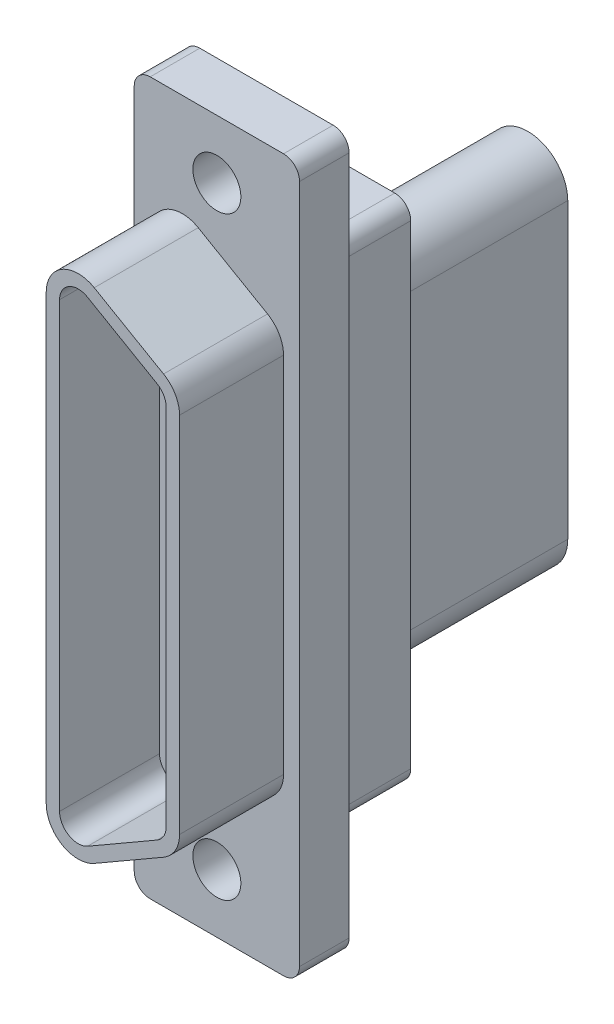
ISO-10303-21;
HEADER;
FILE_DESCRIPTION(('STEP AP214'),'2;1');
FILE_NAME('part.step','',(''),(''),'','','');
FILE_SCHEMA(('AUTOMOTIVE_DESIGN { 1 0 10303 214 1 1 1 1 }'));
ENDSEC;
DATA;
#1=APPLICATION_CONTEXT('core data for automotive mechanical design processes');
#2=APPLICATION_PROTOCOL_DEFINITION('international standard','automotive_design',2000,#1);
#3=PRODUCT_CONTEXT('',#1,'mechanical');
#4=PRODUCT('Part','Part','',(#3));
#5=PRODUCT_RELATED_PRODUCT_CATEGORY('part','',(#4));
#6=PRODUCT_DEFINITION_FORMATION('','',#4);
#7=PRODUCT_DEFINITION_CONTEXT('part definition',#1,'design');
#8=PRODUCT_DEFINITION('design','',#6,#7);
#9=PRODUCT_DEFINITION_SHAPE('','',#8);
#10=(LENGTH_UNIT() NAMED_UNIT(*) SI_UNIT(.MILLI.,.METRE.));
#11=(NAMED_UNIT(*) PLANE_ANGLE_UNIT() SI_UNIT($,.RADIAN.));
#12=(NAMED_UNIT(*) SI_UNIT($,.STERADIAN.) SOLID_ANGLE_UNIT());
#13=UNCERTAINTY_MEASURE_WITH_UNIT(LENGTH_MEASURE(1.E-05),#10,'distance_accuracy_value','');
#14=(GEOMETRIC_REPRESENTATION_CONTEXT(3) GLOBAL_UNCERTAINTY_ASSIGNED_CONTEXT((#13)) GLOBAL_UNIT_ASSIGNED_CONTEXT((#10,
#11,#12)) REPRESENTATION_CONTEXT('',''));
#15=CARTESIAN_POINT('',(0.,0.,0.));
#16=DIRECTION('',(0.,0.,1.));
#17=DIRECTION('',(1.,0.,0.));
#18=AXIS2_PLACEMENT_3D('',#15,#16,#17);
#19=CARTESIAN_POINT('',(1.651,8.64728941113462,7.3152));
#20=DIRECTION('',(0.,0.,1.));
#21=DIRECTION('',(1.,0.,0.));
#22=AXIS2_PLACEMENT_3D('',#19,#20,#21);
#23=CYLINDRICAL_SURFACE('',#22,0.889);
#24=CARTESIAN_POINT('',(1.651,8.64728941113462,2.5527));
#25=DIRECTION('',(0.,0.,1.));
#26=DIRECTION('',(1.,0.,0.));
#27=AXIS2_PLACEMENT_3D('',#24,#25,#26);
#28=CIRCLE('',#27,0.889);
#29=CARTESIAN_POINT('',(2.54,8.64728941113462,2.5527));
#30=VERTEX_POINT('',#29);
#31=CARTESIAN_POINT('',(2.09550000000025,9.41718599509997,2.5527));
#32=VERTEX_POINT('',#31);
#33=EDGE_CURVE('E263',#30,#32,#28,.T.);
#34=ORIENTED_EDGE('',*,*,#33,.F.);
#35=DIRECTION('',(0.,0.,-1.));
#36=VECTOR('',#35,1.);
#37=CARTESIAN_POINT('',(2.54,8.64728941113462,7.3152));
#38=LINE('',#37,#36);
#39=CARTESIAN_POINT('',(2.54,8.64728941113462,7.3152));
#40=VERTEX_POINT('',#39);
#41=EDGE_CURVE('E261',#30,#40,#38,.F.);
#42=ORIENTED_EDGE('',*,*,#41,.T.);
#43=CARTESIAN_POINT('',(1.651,8.64728941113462,7.3152));
#44=DIRECTION('',(0.,0.,1.));
#45=DIRECTION('',(1.,0.,0.));
#46=AXIS2_PLACEMENT_3D('',#43,#44,#45);
#47=CIRCLE('',#46,0.889);
#48=CARTESIAN_POINT('',(2.09550000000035,9.41718599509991,7.3152));
#49=VERTEX_POINT('',#48);
#50=EDGE_CURVE('E19',#49,#40,#47,.F.);
#51=ORIENTED_EDGE('',*,*,#50,.F.);
#52=DIRECTION('',(0.,0.,1.));
#53=VECTOR('',#52,1.);
#54=CARTESIAN_POINT('',(2.0955,9.41718599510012,7.3152));
#55=LINE('',#54,#53);
#56=EDGE_CURVE('E313',#49,#32,#55,.F.);
#57=ORIENTED_EDGE('',*,*,#56,.T.);
#58=EDGE_LOOP('',(#34,#42,#51,#57));
#59=FACE_BOUND('',#58,.T.);
#60=ADVANCED_FACE('F16',(#59),#23,.F.);
#61=CARTESIAN_POINT('',(1.651,-8.64728941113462,7.3152));
#62=DIRECTION('',(0.,0.,1.));
#63=DIRECTION('',(1.,0.,0.));
#64=AXIS2_PLACEMENT_3D('',#61,#62,#63);
#65=CYLINDRICAL_SURFACE('',#64,0.889);
#66=CARTESIAN_POINT('',(1.651,-8.64728941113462,2.5527));
#67=DIRECTION('',(0.,0.,1.));
#68=DIRECTION('',(1.,0.,0.));
#69=AXIS2_PLACEMENT_3D('',#66,#67,#68);
#70=CIRCLE('',#69,0.889);
#71=CARTESIAN_POINT('',(2.09550000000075,-9.41718599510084,2.5527));
#72=VERTEX_POINT('',#71);
#73=CARTESIAN_POINT('',(2.54,-8.64728941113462,2.5527));
#74=VERTEX_POINT('',#73);
#75=EDGE_CURVE('E412',#72,#74,#70,.T.);
#76=ORIENTED_EDGE('',*,*,#75,.F.);
#77=DIRECTION('',(0.,0.,1.));
#78=VECTOR('',#77,1.);
#79=CARTESIAN_POINT('',(2.0955000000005,-9.41718599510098,7.3152));
#80=LINE('',#79,#78);
#81=CARTESIAN_POINT('',(2.0955000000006,-9.41718599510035,7.3152));
#82=VERTEX_POINT('',#81);
#83=EDGE_CURVE('E306',#72,#82,#80,.T.);
#84=ORIENTED_EDGE('',*,*,#83,.T.);
#85=CARTESIAN_POINT('',(1.651,-8.64728941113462,7.3152));
#86=DIRECTION('',(0.,0.,1.));
#87=DIRECTION('',(1.,0.,0.));
#88=AXIS2_PLACEMENT_3D('',#85,#86,#87);
#89=CIRCLE('',#88,0.889);
#90=CARTESIAN_POINT('',(2.54,-8.64728941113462,7.3152));
#91=VERTEX_POINT('',#90);
#92=EDGE_CURVE('E259',#91,#82,#89,.F.);
#93=ORIENTED_EDGE('',*,*,#92,.F.);
#94=DIRECTION('',(0.,0.,-1.));
#95=VECTOR('',#94,1.);
#96=CARTESIAN_POINT('',(2.54,-8.64728941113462,7.3152));
#97=LINE('',#96,#95);
#98=EDGE_CURVE('E272',#91,#74,#97,.T.);
#99=ORIENTED_EDGE('',*,*,#98,.T.);
#100=EDGE_LOOP('',(#76,#84,#93,#99));
#101=FACE_BOUND('',#100,.T.);
#102=ADVANCED_FACE('F417',(#101),#65,.F.);
#103=CARTESIAN_POINT('',(0.,0.,2.5527));
#104=DIRECTION('',(0.,0.,1.));
#105=DIRECTION('',(1.,0.,0.));
#106=AXIS2_PLACEMENT_3D('',#103,#104,#105);
#107=PLANE('',#106);
#108=CARTESIAN_POINT('',(-1.651,10.5537,2.5527));
#109=DIRECTION('',(0.,0.,1.));
#110=DIRECTION('',(1.,0.,0.));
#111=AXIS2_PLACEMENT_3D('',#108,#109,#110);
#112=CIRCLE('',#111,0.889);
#113=CARTESIAN_POINT('',(-1.20650000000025,11.3235965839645,2.5527));
#114=VERTEX_POINT('',#113);
#115=CARTESIAN_POINT('',(-2.54,10.5537,2.5527));
#116=VERTEX_POINT('',#115);
#117=EDGE_CURVE('E315',#114,#116,#112,.T.);
#118=ORIENTED_EDGE('',*,*,#117,.T.);
#119=DIRECTION('',(0.,1.,0.));
#120=VECTOR('',#119,1.);
#121=CARTESIAN_POINT('',(-2.54,10.5537,2.5527));
#122=LINE('',#121,#120);
#123=CARTESIAN_POINT('',(-2.54,-10.5537,2.5527));
#124=VERTEX_POINT('',#123);
#125=EDGE_CURVE('E299',#116,#124,#122,.F.);
#126=ORIENTED_EDGE('',*,*,#125,.T.);
#127=CARTESIAN_POINT('',(-1.651,-10.5537,2.5527));
#128=DIRECTION('',(0.,0.,1.));
#129=DIRECTION('',(1.,0.,0.));
#130=AXIS2_PLACEMENT_3D('',#127,#128,#129);
#131=CIRCLE('',#130,0.889);
#132=CARTESIAN_POINT('',(-1.20649999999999,-11.3235965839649,2.5527));
#133=VERTEX_POINT('',#132);
#134=EDGE_CURVE('E305',#124,#133,#131,.T.);
#135=ORIENTED_EDGE('',*,*,#134,.T.);
#136=DIRECTION('',(0.866025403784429,0.500000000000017,0.));
#137=VECTOR('',#136,1.);
#138=CARTESIAN_POINT('',(-1.2065,-11.3235965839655,2.5527));
#139=LINE('',#138,#137);
#140=EDGE_CURVE('E267',#133,#72,#139,.T.);
#141=ORIENTED_EDGE('',*,*,#140,.T.);
#142=ORIENTED_EDGE('',*,*,#75,.T.);
#143=DIRECTION('',(0.,1.,0.));
#144=VECTOR('',#143,1.);
#145=CARTESIAN_POINT('',(2.54,-8.64728941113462,2.5527));
#146=LINE('',#145,#144);
#147=EDGE_CURVE('E268',#74,#30,#146,.T.);
#148=ORIENTED_EDGE('',*,*,#147,.T.);
#149=ORIENTED_EDGE('',*,*,#33,.T.);
#150=DIRECTION('',(-0.866025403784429,0.500000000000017,0.));
#151=VECTOR('',#150,1.);
#152=CARTESIAN_POINT('',(2.0955,9.41718599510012,2.5527));
#153=LINE('',#152,#151);
#154=EDGE_CURVE('E312',#32,#114,#153,.T.);
#155=ORIENTED_EDGE('',*,*,#154,.T.);
#156=EDGE_LOOP('',(#118,#126,#135,#141,#142,#148,#149,#155));
#157=FACE_BOUND('',#156,.T.);
#158=ADVANCED_FACE('F725',(#157),#107,.T.);
#159=CARTESIAN_POINT('',(-1.651,10.5537,7.3152));
#160=DIRECTION('',(0.,0.,1.));
#161=DIRECTION('',(1.,0.,0.));
#162=AXIS2_PLACEMENT_3D('',#159,#160,#161);
#163=CYLINDRICAL_SURFACE('',#162,0.889);
#164=ORIENTED_EDGE('',*,*,#117,.F.);
#165=DIRECTION('',(0.,0.,1.));
#166=VECTOR('',#165,1.);
#167=CARTESIAN_POINT('',(-1.2065000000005,11.3235965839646,7.3152));
#168=LINE('',#167,#166);
#169=CARTESIAN_POINT('',(-1.2064999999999,11.3235965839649,7.3152));
#170=VERTEX_POINT('',#169);
#171=EDGE_CURVE('E310',#114,#170,#168,.T.);
#172=ORIENTED_EDGE('',*,*,#171,.T.);
#173=CARTESIAN_POINT('',(-1.651,10.5537,7.3152));
#174=DIRECTION('',(0.,0.,1.));
#175=DIRECTION('',(1.,0.,0.));
#176=AXIS2_PLACEMENT_3D('',#173,#174,#175);
#177=CIRCLE('',#176,0.889);
#178=CARTESIAN_POINT('',(-2.54,10.5537,7.3152));
#179=VERTEX_POINT('',#178);
#180=EDGE_CURVE('E278',#179,#170,#177,.F.);
#181=ORIENTED_EDGE('',*,*,#180,.F.);
#182=DIRECTION('',(0.,0.,1.));
#183=VECTOR('',#182,1.);
#184=CARTESIAN_POINT('',(-2.54,10.5537,7.3152));
#185=LINE('',#184,#183);
#186=EDGE_CURVE('E300',#179,#116,#185,.F.);
#187=ORIENTED_EDGE('',*,*,#186,.T.);
#188=EDGE_LOOP('',(#164,#172,#181,#187));
#189=FACE_BOUND('',#188,.T.);
#190=ADVANCED_FACE('F721',(#189),#163,.F.);
#191=CARTESIAN_POINT('',(2.0955,9.41718599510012,7.3152));
#192=DIRECTION('',(0.500000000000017,0.866025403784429,0.));
#193=DIRECTION('',(-0.866025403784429,0.500000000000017,0.));
#194=AXIS2_PLACEMENT_3D('',#191,#192,#193);
#195=PLANE('',#194);
#196=ORIENTED_EDGE('',*,*,#154,.F.);
#197=ORIENTED_EDGE('',*,*,#56,.F.);
#198=DIRECTION('',(0.866025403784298,-0.500000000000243,0.));
#199=VECTOR('',#198,1.);
#200=CARTESIAN_POINT('',(-1.2065,11.3235965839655,7.3152));
#201=LINE('',#200,#199);
#202=EDGE_CURVE('E258',#170,#49,#201,.T.);
#203=ORIENTED_EDGE('',*,*,#202,.F.);
#204=ORIENTED_EDGE('',*,*,#171,.F.);
#205=EDGE_LOOP('',(#196,#197,#203,#204));
#206=FACE_BOUND('',#205,.T.);
#207=ADVANCED_FACE('F718',(#206),#195,.F.);
#208=CARTESIAN_POINT('',(2.54,-8.64728941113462,7.3152));
#209=DIRECTION('',(1.,0.,0.));
#210=DIRECTION('',(0.,0.,-1.));
#211=AXIS2_PLACEMENT_3D('',#208,#209,#210);
#212=PLANE('',#211);
#213=ORIENTED_EDGE('',*,*,#147,.F.);
#214=ORIENTED_EDGE('',*,*,#98,.F.);
#215=DIRECTION('',(0.,1.,0.));
#216=VECTOR('',#215,1.);
#217=CARTESIAN_POINT('',(2.54,0.,7.3152));
#218=LINE('',#217,#216);
#219=EDGE_CURVE('E255',#40,#91,#218,.F.);
#220=ORIENTED_EDGE('',*,*,#219,.F.);
#221=ORIENTED_EDGE('',*,*,#41,.F.);
#222=EDGE_LOOP('',(#213,#214,#220,#221));
#223=FACE_BOUND('',#222,.T.);
#224=ADVANCED_FACE('F271',(#223),#212,.F.);
#225=CARTESIAN_POINT('',(-1.2065,-11.3235965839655,7.3152));
#226=DIRECTION('',(0.500000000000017,-0.866025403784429,0.));
#227=DIRECTION('',(0.866025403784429,0.500000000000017,0.));
#228=AXIS2_PLACEMENT_3D('',#225,#226,#227);
#229=PLANE('',#228);
#230=ORIENTED_EDGE('',*,*,#140,.F.);
#231=DIRECTION('',(0.,0.,1.));
#232=VECTOR('',#231,1.);
#233=CARTESIAN_POINT('',(-1.20650000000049,-11.3235965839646,7.3152));
#234=LINE('',#233,#232);
#235=CARTESIAN_POINT('',(-1.20649999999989,-11.3235965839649,7.3152));
#236=VERTEX_POINT('',#235);
#237=EDGE_CURVE('E303',#133,#236,#234,.T.);
#238=ORIENTED_EDGE('',*,*,#237,.T.);
#239=DIRECTION('',(-0.866025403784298,-0.500000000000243,0.));
#240=VECTOR('',#239,1.);
#241=CARTESIAN_POINT('',(2.0955,-9.41718599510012,7.3152));
#242=LINE('',#241,#240);
#243=EDGE_CURVE('E273',#82,#236,#242,.T.);
#244=ORIENTED_EDGE('',*,*,#243,.F.);
#245=ORIENTED_EDGE('',*,*,#83,.F.);
#246=EDGE_LOOP('',(#230,#238,#244,#245));
#247=FACE_BOUND('',#246,.T.);
#248=ADVANCED_FACE('F420',(#247),#229,.F.);
#249=CARTESIAN_POINT('',(-1.651,-10.5537,7.3152));
#250=DIRECTION('',(0.,0.,1.));
#251=DIRECTION('',(1.,0.,0.));
#252=AXIS2_PLACEMENT_3D('',#249,#250,#251);
#253=CYLINDRICAL_SURFACE('',#252,0.889);
#254=ORIENTED_EDGE('',*,*,#134,.F.);
#255=DIRECTION('',(0.,0.,1.));
#256=VECTOR('',#255,1.);
#257=CARTESIAN_POINT('',(-2.54,-10.5537,7.3152));
#258=LINE('',#257,#256);
#259=CARTESIAN_POINT('',(-2.54,-10.5537,7.3152));
#260=VERTEX_POINT('',#259);
#261=EDGE_CURVE('E296',#124,#260,#258,.T.);
#262=ORIENTED_EDGE('',*,*,#261,.T.);
#263=CARTESIAN_POINT('',(-1.651,-10.5537,7.3152));
#264=DIRECTION('',(0.,0.,1.));
#265=DIRECTION('',(1.,0.,0.));
#266=AXIS2_PLACEMENT_3D('',#263,#264,#265);
#267=CIRCLE('',#266,0.889);
#268=EDGE_CURVE('E276',#236,#260,#267,.F.);
#269=ORIENTED_EDGE('',*,*,#268,.F.);
#270=ORIENTED_EDGE('',*,*,#237,.F.);
#271=EDGE_LOOP('',(#254,#262,#269,#270));
#272=FACE_BOUND('',#271,.T.);
#273=ADVANCED_FACE('F425',(#272),#253,.F.);
#274=CARTESIAN_POINT('',(-2.54,10.5537,7.3152));
#275=DIRECTION('',(-1.,0.,0.));
#276=DIRECTION('',(0.,0.,1.));
#277=AXIS2_PLACEMENT_3D('',#274,#275,#276);
#278=PLANE('',#277);
#279=ORIENTED_EDGE('',*,*,#125,.F.);
#280=ORIENTED_EDGE('',*,*,#186,.F.);
#281=DIRECTION('',(0.,1.,0.));
#282=VECTOR('',#281,1.);
#283=CARTESIAN_POINT('',(-2.54,0.,7.3152));
#284=LINE('',#283,#282);
#285=EDGE_CURVE('E399',#260,#179,#284,.T.);
#286=ORIENTED_EDGE('',*,*,#285,.F.);
#287=ORIENTED_EDGE('',*,*,#261,.F.);
#288=EDGE_LOOP('',(#279,#280,#286,#287));
#289=FACE_BOUND('',#288,.T.);
#290=ADVANCED_FACE('F708',(#289),#278,.F.);
#291=CARTESIAN_POINT('',(1.651,8.64728941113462,2.3622));
#292=DIRECTION('',(0.,0.,1.));
#293=DIRECTION('',(1.,0.,0.));
#294=AXIS2_PLACEMENT_3D('',#291,#292,#293);
#295=CYLINDRICAL_SURFACE('',#294,1.524);
#296=DIRECTION('',(0.,0.,-1.));
#297=VECTOR('',#296,1.);
#298=CARTESIAN_POINT('',(3.175,8.64728941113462,2.3622));
#299=LINE('',#298,#297);
#300=CARTESIAN_POINT('',(3.175,8.64728941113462,2.3622));
#301=VERTEX_POINT('',#300);
#302=CARTESIAN_POINT('',(3.175,8.64728941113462,7.3152));
#303=VERTEX_POINT('',#302);
#304=EDGE_CURVE('E290',#301,#303,#299,.F.);
#305=ORIENTED_EDGE('',*,*,#304,.F.);
#306=CARTESIAN_POINT('',(1.651,8.64728941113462,2.3622));
#307=DIRECTION('',(0.,0.,1.));
#308=DIRECTION('',(1.,0.,0.));
#309=AXIS2_PLACEMENT_3D('',#306,#307,#308);
#310=CIRCLE('',#309,1.524);
#311=CARTESIAN_POINT('',(2.41300000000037,9.96711212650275,2.3622));
#312=VERTEX_POINT('',#311);
#313=EDGE_CURVE('E298',#301,#312,#310,.T.);
#314=ORIENTED_EDGE('',*,*,#313,.T.);
#315=DIRECTION('',(0.,0.,1.));
#316=VECTOR('',#315,1.);
#317=CARTESIAN_POINT('',(2.413,9.96711212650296,2.3622));
#318=LINE('',#317,#316);
#319=CARTESIAN_POINT('',(2.4130000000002,9.96711212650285,7.3152));
#320=VERTEX_POINT('',#319);
#321=EDGE_CURVE('E294',#320,#312,#318,.F.);
#322=ORIENTED_EDGE('',*,*,#321,.F.);
#323=CARTESIAN_POINT('',(1.651,8.64728941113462,7.3152));
#324=DIRECTION('',(0.,0.,1.));
#325=DIRECTION('',(1.,0.,0.));
#326=AXIS2_PLACEMENT_3D('',#323,#324,#325);
#327=CIRCLE('',#326,1.524);
#328=EDGE_CURVE('E402',#303,#320,#327,.T.);
#329=ORIENTED_EDGE('',*,*,#328,.F.);
#330=EDGE_LOOP('',(#305,#314,#322,#329));
#331=FACE_BOUND('',#330,.T.);
#332=ADVANCED_FACE('F704',(#331),#295,.T.);
#333=CARTESIAN_POINT('',(1.651,-8.64728941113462,2.3622));
#334=DIRECTION('',(0.,0.,1.));
#335=DIRECTION('',(1.,0.,0.));
#336=AXIS2_PLACEMENT_3D('',#333,#334,#335);
#337=CYLINDRICAL_SURFACE('',#336,1.524);
#338=DIRECTION('',(0.,0.,1.));
#339=VECTOR('',#338,1.);
#340=CARTESIAN_POINT('',(2.4130000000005,-9.96711212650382,2.3622));
#341=LINE('',#340,#339);
#342=CARTESIAN_POINT('',(2.41300000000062,-9.96711212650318,2.3622));
#343=VERTEX_POINT('',#342);
#344=CARTESIAN_POINT('',(2.4130000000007,-9.96711212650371,7.3152));
#345=VERTEX_POINT('',#344);
#346=EDGE_CURVE('E285',#343,#345,#341,.T.);
#347=ORIENTED_EDGE('',*,*,#346,.F.);
#348=CARTESIAN_POINT('',(1.651,-8.64728941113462,2.3622));
#349=DIRECTION('',(0.,0.,1.));
#350=DIRECTION('',(1.,0.,0.));
#351=AXIS2_PLACEMENT_3D('',#348,#349,#350);
#352=CIRCLE('',#351,1.524);
#353=CARTESIAN_POINT('',(3.175,-8.64728941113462,2.3622));
#354=VERTEX_POINT('',#353);
#355=EDGE_CURVE('E406',#343,#354,#352,.T.);
#356=ORIENTED_EDGE('',*,*,#355,.T.);
#357=DIRECTION('',(0.,0.,-1.));
#358=VECTOR('',#357,1.);
#359=CARTESIAN_POINT('',(3.175,-8.64728941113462,2.3622));
#360=LINE('',#359,#358);
#361=CARTESIAN_POINT('',(3.175,-8.64728941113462,7.3152));
#362=VERTEX_POINT('',#361);
#363=EDGE_CURVE('E289',#362,#354,#360,.T.);
#364=ORIENTED_EDGE('',*,*,#363,.F.);
#365=CARTESIAN_POINT('',(1.651,-8.64728941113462,7.3152));
#366=DIRECTION('',(0.,0.,1.));
#367=DIRECTION('',(1.,0.,0.));
#368=AXIS2_PLACEMENT_3D('',#365,#366,#367);
#369=CIRCLE('',#368,1.524);
#370=EDGE_CURVE('E404',#345,#362,#369,.T.);
#371=ORIENTED_EDGE('',*,*,#370,.F.);
#372=EDGE_LOOP('',(#347,#356,#364,#371));
#373=FACE_BOUND('',#372,.T.);
#374=ADVANCED_FACE('F701',(#373),#337,.T.);
#375=CARTESIAN_POINT('',(0.,0.,7.3152));
#376=DIRECTION('',(0.,0.,1.));
#377=DIRECTION('',(1.,0.,0.));
#378=AXIS2_PLACEMENT_3D('',#375,#376,#377);
#379=PLANE('',#378);
#380=ORIENTED_EDGE('',*,*,#268,.T.);
#381=ORIENTED_EDGE('',*,*,#285,.T.);
#382=ORIENTED_EDGE('',*,*,#180,.T.);
#383=ORIENTED_EDGE('',*,*,#202,.T.);
#384=ORIENTED_EDGE('',*,*,#50,.T.);
#385=ORIENTED_EDGE('',*,*,#219,.T.);
#386=ORIENTED_EDGE('',*,*,#92,.T.);
#387=ORIENTED_EDGE('',*,*,#243,.T.);
#388=EDGE_LOOP('',(#380,#381,#382,#383,#384,#385,#386,#387));
#389=FACE_BOUND('',#388,.T.);
#390=CARTESIAN_POINT('',(-1.651,10.5537,7.3152));
#391=DIRECTION('',(0.,0.,1.));
#392=DIRECTION('',(1.,0.,0.));
#393=AXIS2_PLACEMENT_3D('',#390,#391,#392);
#394=CIRCLE('',#393,1.524);
#395=CARTESIAN_POINT('',(-3.175,10.5537,7.3152));
#396=VERTEX_POINT('',#395);
#397=CARTESIAN_POINT('',(-0.889000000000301,11.8735227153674,7.3152));
#398=VERTEX_POINT('',#397);
#399=EDGE_CURVE('E397',#396,#398,#394,.F.);
#400=ORIENTED_EDGE('',*,*,#399,.F.);
#401=DIRECTION('',(0.,1.,0.));
#402=VECTOR('',#401,1.);
#403=CARTESIAN_POINT('',(-3.175,10.5537,7.3152));
#404=LINE('',#403,#402);
#405=CARTESIAN_POINT('',(-3.175,-10.5537,7.3152));
#406=VERTEX_POINT('',#405);
#407=EDGE_CURVE('E432',#406,#396,#404,.T.);
#408=ORIENTED_EDGE('',*,*,#407,.F.);
#409=CARTESIAN_POINT('',(-1.651,-10.5537,7.3152));
#410=DIRECTION('',(0.,0.,1.));
#411=DIRECTION('',(1.,0.,0.));
#412=AXIS2_PLACEMENT_3D('',#409,#410,#411);
#413=CIRCLE('',#412,1.524);
#414=CARTESIAN_POINT('',(-0.888999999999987,-11.8735227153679,7.3152));
#415=VERTEX_POINT('',#414);
#416=EDGE_CURVE('E394',#415,#406,#413,.F.);
#417=ORIENTED_EDGE('',*,*,#416,.F.);
#418=DIRECTION('',(0.866025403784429,0.500000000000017,0.));
#419=VECTOR('',#418,1.);
#420=CARTESIAN_POINT('',(-0.889,-11.8735227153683,7.3152));
#421=LINE('',#420,#419);
#422=EDGE_CURVE('E282',#345,#415,#421,.F.);
#423=ORIENTED_EDGE('',*,*,#422,.F.);
#424=ORIENTED_EDGE('',*,*,#370,.T.);
#425=DIRECTION('',(0.,1.,0.));
#426=VECTOR('',#425,1.);
#427=CARTESIAN_POINT('',(3.175,-8.64728941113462,7.3152));
#428=LINE('',#427,#426);
#429=EDGE_CURVE('E286',#303,#362,#428,.F.);
#430=ORIENTED_EDGE('',*,*,#429,.F.);
#431=ORIENTED_EDGE('',*,*,#328,.T.);
#432=DIRECTION('',(-0.866025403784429,0.500000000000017,0.));
#433=VECTOR('',#432,1.);
#434=CARTESIAN_POINT('',(2.413,9.96711212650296,7.3152));
#435=LINE('',#434,#433);
#436=EDGE_CURVE('E291',#398,#320,#435,.F.);
#437=ORIENTED_EDGE('',*,*,#436,.F.);
#438=EDGE_LOOP('',(#400,#408,#417,#423,#424,#430,#431,#437));
#439=FACE_BOUND('',#438,.T.);
#440=ADVANCED_FACE('F252',(#389,#439),#379,.T.);
#441=CARTESIAN_POINT('',(-1.651,10.5537,2.3622));
#442=DIRECTION('',(0.,0.,1.));
#443=DIRECTION('',(1.,0.,0.));
#444=AXIS2_PLACEMENT_3D('',#441,#442,#443);
#445=CYLINDRICAL_SURFACE('',#444,1.524);
#446=DIRECTION('',(0.,0.,1.));
#447=VECTOR('',#446,1.);
#448=CARTESIAN_POINT('',(-0.889000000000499,11.8735227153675,2.3622));
#449=LINE('',#448,#447);
#450=CARTESIAN_POINT('',(-0.888999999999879,11.8735227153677,2.3622));
#451=VERTEX_POINT('',#450);
#452=EDGE_CURVE('E295',#451,#398,#449,.T.);
#453=ORIENTED_EDGE('',*,*,#452,.F.);
#454=CARTESIAN_POINT('',(-1.651,10.5537,2.3622));
#455=DIRECTION('',(0.,0.,1.));
#456=DIRECTION('',(1.,0.,0.));
#457=AXIS2_PLACEMENT_3D('',#454,#455,#456);
#458=CIRCLE('',#457,1.524);
#459=CARTESIAN_POINT('',(-3.175,10.5537,2.3622));
#460=VERTEX_POINT('',#459);
#461=EDGE_CURVE('E373',#460,#451,#458,.F.);
#462=ORIENTED_EDGE('',*,*,#461,.F.);
#463=DIRECTION('',(0.,0.,1.));
#464=VECTOR('',#463,1.);
#465=CARTESIAN_POINT('',(-3.175,10.5537,2.3622));
#466=LINE('',#465,#464);
#467=EDGE_CURVE('E393',#396,#460,#466,.F.);
#468=ORIENTED_EDGE('',*,*,#467,.F.);
#469=ORIENTED_EDGE('',*,*,#399,.T.);
#470=EDGE_LOOP('',(#453,#462,#468,#469));
#471=FACE_BOUND('',#470,.T.);
#472=ADVANCED_FACE('F694',(#471),#445,.T.);
#473=CARTESIAN_POINT('',(2.413,9.96711212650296,2.3622));
#474=DIRECTION('',(0.500000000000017,0.866025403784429,0.));
#475=DIRECTION('',(-0.866025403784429,0.500000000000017,0.));
#476=AXIS2_PLACEMENT_3D('',#473,#474,#475);
#477=PLANE('',#476);
#478=ORIENTED_EDGE('',*,*,#321,.T.);
#479=DIRECTION('',(0.866025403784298,-0.500000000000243,0.));
#480=VECTOR('',#479,1.);
#481=CARTESIAN_POINT('',(-0.889,11.8735227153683,2.3622));
#482=LINE('',#481,#480);
#483=EDGE_CURVE('E376',#451,#312,#482,.T.);
#484=ORIENTED_EDGE('',*,*,#483,.F.);
#485=ORIENTED_EDGE('',*,*,#452,.T.);
#486=ORIENTED_EDGE('',*,*,#436,.T.);
#487=EDGE_LOOP('',(#478,#484,#485,#486));
#488=FACE_BOUND('',#487,.T.);
#489=ADVANCED_FACE('F690',(#488),#477,.T.);
#490=CARTESIAN_POINT('',(3.175,-8.64728941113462,2.3622));
#491=DIRECTION('',(1.,0.,0.));
#492=DIRECTION('',(0.,0.,-1.));
#493=AXIS2_PLACEMENT_3D('',#490,#491,#492);
#494=PLANE('',#493);
#495=ORIENTED_EDGE('',*,*,#363,.T.);
#496=DIRECTION('',(0.,1.,0.));
#497=VECTOR('',#496,1.);
#498=CARTESIAN_POINT('',(3.175,0.,2.3622));
#499=LINE('',#498,#497);
#500=EDGE_CURVE('E472',#301,#354,#499,.F.);
#501=ORIENTED_EDGE('',*,*,#500,.F.);
#502=ORIENTED_EDGE('',*,*,#304,.T.);
#503=ORIENTED_EDGE('',*,*,#429,.T.);
#504=EDGE_LOOP('',(#495,#501,#502,#503));
#505=FACE_BOUND('',#504,.T.);
#506=ADVANCED_FACE('F686',(#505),#494,.T.);
#507=CARTESIAN_POINT('',(-0.889,-11.8735227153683,2.3622));
#508=DIRECTION('',(0.500000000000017,-0.866025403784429,0.));
#509=DIRECTION('',(0.866025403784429,0.500000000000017,0.));
#510=AXIS2_PLACEMENT_3D('',#507,#508,#509);
#511=PLANE('',#510);
#512=DIRECTION('',(0.,0.,1.));
#513=VECTOR('',#512,1.);
#514=CARTESIAN_POINT('',(-0.889000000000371,-11.8735227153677,2.3622));
#515=LINE('',#514,#513);
#516=CARTESIAN_POINT('',(-0.888999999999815,-11.8735227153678,2.3622));
#517=VERTEX_POINT('',#516);
#518=EDGE_CURVE('E284',#517,#415,#515,.T.);
#519=ORIENTED_EDGE('',*,*,#518,.F.);
#520=DIRECTION('',(-0.866025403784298,-0.500000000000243,0.));
#521=VECTOR('',#520,1.);
#522=CARTESIAN_POINT('',(2.413,-9.96711212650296,2.3622));
#523=LINE('',#522,#521);
#524=EDGE_CURVE('E372',#343,#517,#523,.T.);
#525=ORIENTED_EDGE('',*,*,#524,.F.);
#526=ORIENTED_EDGE('',*,*,#346,.T.);
#527=ORIENTED_EDGE('',*,*,#422,.T.);
#528=EDGE_LOOP('',(#519,#525,#526,#527));
#529=FACE_BOUND('',#528,.T.);
#530=ADVANCED_FACE('F682',(#529),#511,.T.);
#531=CARTESIAN_POINT('',(-1.651,-10.5537,2.3622));
#532=DIRECTION('',(0.,0.,1.));
#533=DIRECTION('',(1.,0.,0.));
#534=AXIS2_PLACEMENT_3D('',#531,#532,#533);
#535=CYLINDRICAL_SURFACE('',#534,1.524);
#536=DIRECTION('',(0.,0.,1.));
#537=VECTOR('',#536,1.);
#538=CARTESIAN_POINT('',(-3.175,-10.5537,2.3622));
#539=LINE('',#538,#537);
#540=CARTESIAN_POINT('',(-3.175,-10.5537,2.3622));
#541=VERTEX_POINT('',#540);
#542=EDGE_CURVE('E396',#541,#406,#539,.T.);
#543=ORIENTED_EDGE('',*,*,#542,.F.);
#544=CARTESIAN_POINT('',(-1.651,-10.5537,2.3622));
#545=DIRECTION('',(0.,0.,1.));
#546=DIRECTION('',(1.,0.,0.));
#547=AXIS2_PLACEMENT_3D('',#544,#545,#546);
#548=CIRCLE('',#547,1.524);
#549=EDGE_CURVE('E368',#517,#541,#548,.F.);
#550=ORIENTED_EDGE('',*,*,#549,.F.);
#551=ORIENTED_EDGE('',*,*,#518,.T.);
#552=ORIENTED_EDGE('',*,*,#416,.T.);
#553=EDGE_LOOP('',(#543,#550,#551,#552));
#554=FACE_BOUND('',#553,.T.);
#555=ADVANCED_FACE('F678',(#554),#535,.T.);
#556=CARTESIAN_POINT('',(-3.175,10.5537,2.3622));
#557=DIRECTION('',(-1.,0.,0.));
#558=DIRECTION('',(0.,0.,1.));
#559=AXIS2_PLACEMENT_3D('',#556,#557,#558);
#560=PLANE('',#559);
#561=ORIENTED_EDGE('',*,*,#467,.T.);
#562=DIRECTION('',(0.,1.,0.));
#563=VECTOR('',#562,1.);
#564=CARTESIAN_POINT('',(-3.175,0.,2.3622));
#565=LINE('',#564,#563);
#566=EDGE_CURVE('E371',#541,#460,#565,.T.);
#567=ORIENTED_EDGE('',*,*,#566,.F.);
#568=ORIENTED_EDGE('',*,*,#542,.T.);
#569=ORIENTED_EDGE('',*,*,#407,.T.);
#570=EDGE_LOOP('',(#561,#567,#568,#569));
#571=FACE_BOUND('',#570,.T.);
#572=ADVANCED_FACE('F674',(#571),#560,.T.);
#573=CARTESIAN_POINT('',(3.175,-16.1925,0.));
#574=DIRECTION('',(0.,0.,1.));
#575=DIRECTION('',(1.,0.,0.));
#576=AXIS2_PLACEMENT_3D('',#573,#574,#575);
#577=CYLINDRICAL_SURFACE('',#576,0.762);
#578=DIRECTION('',(0.,0.,-1.));
#579=VECTOR('',#578,1.);
#580=CARTESIAN_POINT('',(3.175,-16.9545,0.));
#581=LINE('',#580,#579);
#582=CARTESIAN_POINT('',(3.175,-16.9545,0.));
#583=VERTEX_POINT('',#582);
#584=CARTESIAN_POINT('',(3.175,-16.9545,2.3622));
#585=VERTEX_POINT('',#584);
#586=EDGE_CURVE('E455',#583,#585,#581,.F.);
#587=ORIENTED_EDGE('',*,*,#586,.F.);
#588=CARTESIAN_POINT('',(3.175,-16.1925,0.));
#589=DIRECTION('',(0.,0.,1.));
#590=DIRECTION('',(1.,0.,0.));
#591=AXIS2_PLACEMENT_3D('',#588,#589,#590);
#592=CIRCLE('',#591,0.762);
#593=CARTESIAN_POINT('',(3.937,-16.1925,0.));
#594=VERTEX_POINT('',#593);
#595=EDGE_CURVE('E391',#583,#594,#592,.T.);
#596=ORIENTED_EDGE('',*,*,#595,.T.);
#597=DIRECTION('',(0.,0.,-1.));
#598=VECTOR('',#597,1.);
#599=CARTESIAN_POINT('',(3.937,-16.1925,0.));
#600=LINE('',#599,#598);
#601=CARTESIAN_POINT('',(3.937,-16.1925,2.3622));
#602=VERTEX_POINT('',#601);
#603=EDGE_CURVE('E459',#602,#594,#600,.T.);
#604=ORIENTED_EDGE('',*,*,#603,.F.);
#605=CARTESIAN_POINT('',(3.175,-16.1925,2.3622));
#606=DIRECTION('',(0.,0.,1.));
#607=DIRECTION('',(1.,0.,0.));
#608=AXIS2_PLACEMENT_3D('',#605,#606,#607);
#609=CIRCLE('',#608,0.762);
#610=EDGE_CURVE('E383',#585,#602,#609,.T.);
#611=ORIENTED_EDGE('',*,*,#610,.F.);
#612=EDGE_LOOP('',(#587,#596,#604,#611));
#613=FACE_BOUND('',#612,.T.);
#614=ADVANCED_FACE('F670',(#613),#577,.T.);
#615=CARTESIAN_POINT('',(3.175,16.1925,0.));
#616=DIRECTION('',(0.,0.,1.));
#617=DIRECTION('',(1.,0.,0.));
#618=AXIS2_PLACEMENT_3D('',#615,#616,#617);
#619=CYLINDRICAL_SURFACE('',#618,0.762);
#620=DIRECTION('',(0.,0.,-1.));
#621=VECTOR('',#620,1.);
#622=CARTESIAN_POINT('',(3.937,16.1925,0.));
#623=LINE('',#622,#621);
#624=CARTESIAN_POINT('',(3.937,16.1925,0.));
#625=VERTEX_POINT('',#624);
#626=CARTESIAN_POINT('',(3.937,16.1925,2.3622));
#627=VERTEX_POINT('',#626);
#628=EDGE_CURVE('E460',#625,#627,#623,.F.);
#629=ORIENTED_EDGE('',*,*,#628,.F.);
#630=CARTESIAN_POINT('',(3.175,16.1925,0.));
#631=DIRECTION('',(0.,0.,1.));
#632=DIRECTION('',(1.,0.,0.));
#633=AXIS2_PLACEMENT_3D('',#630,#631,#632);
#634=CIRCLE('',#633,0.762);
#635=CARTESIAN_POINT('',(3.175,16.9545,0.));
#636=VERTEX_POINT('',#635);
#637=EDGE_CURVE('E389',#625,#636,#634,.T.);
#638=ORIENTED_EDGE('',*,*,#637,.T.);
#639=DIRECTION('',(0.,0.,1.));
#640=VECTOR('',#639,1.);
#641=CARTESIAN_POINT('',(3.175,16.9545,0.));
#642=LINE('',#641,#640);
#643=CARTESIAN_POINT('',(3.175,16.9545,2.3622));
#644=VERTEX_POINT('',#643);
#645=EDGE_CURVE('E464',#644,#636,#642,.F.);
#646=ORIENTED_EDGE('',*,*,#645,.F.);
#647=CARTESIAN_POINT('',(3.175,16.1925,2.3622));
#648=DIRECTION('',(0.,0.,1.));
#649=DIRECTION('',(1.,0.,0.));
#650=AXIS2_PLACEMENT_3D('',#647,#648,#649);
#651=CIRCLE('',#650,0.762);
#652=EDGE_CURVE('E381',#627,#644,#651,.T.);
#653=ORIENTED_EDGE('',*,*,#652,.F.);
#654=EDGE_LOOP('',(#629,#638,#646,#653));
#655=FACE_BOUND('',#654,.T.);
#656=ADVANCED_FACE('F666',(#655),#619,.T.);
#657=CARTESIAN_POINT('',(-3.175,-16.1925,0.));
#658=DIRECTION('',(0.,0.,1.));
#659=DIRECTION('',(1.,0.,0.));
#660=AXIS2_PLACEMENT_3D('',#657,#658,#659);
#661=CYLINDRICAL_SURFACE('',#660,0.762);
#662=DIRECTION('',(0.,0.,1.));
#663=VECTOR('',#662,1.);
#664=CARTESIAN_POINT('',(-3.937,-16.1925,0.));
#665=LINE('',#664,#663);
#666=CARTESIAN_POINT('',(-3.937,-16.1925,0.));
#667=VERTEX_POINT('',#666);
#668=CARTESIAN_POINT('',(-3.937,-16.1925,2.3622));
#669=VERTEX_POINT('',#668);
#670=EDGE_CURVE('E469',#667,#669,#665,.T.);
#671=ORIENTED_EDGE('',*,*,#670,.F.);
#672=CARTESIAN_POINT('',(-3.175,-16.1925,0.));
#673=DIRECTION('',(0.,0.,1.));
#674=DIRECTION('',(1.,0.,0.));
#675=AXIS2_PLACEMENT_3D('',#672,#673,#674);
#676=CIRCLE('',#675,0.762);
#677=CARTESIAN_POINT('',(-3.175,-16.9545,0.));
#678=VERTEX_POINT('',#677);
#679=EDGE_CURVE('E387',#667,#678,#676,.T.);
#680=ORIENTED_EDGE('',*,*,#679,.T.);
#681=DIRECTION('',(0.,0.,-1.));
#682=VECTOR('',#681,1.);
#683=CARTESIAN_POINT('',(-3.175,-16.9545,0.));
#684=LINE('',#683,#682);
#685=CARTESIAN_POINT('',(-3.175,-16.9545,2.3622));
#686=VERTEX_POINT('',#685);
#687=EDGE_CURVE('E454',#686,#678,#684,.T.);
#688=ORIENTED_EDGE('',*,*,#687,.F.);
#689=CARTESIAN_POINT('',(-3.175,-16.1925,2.3622));
#690=DIRECTION('',(0.,0.,1.));
#691=DIRECTION('',(1.,0.,0.));
#692=AXIS2_PLACEMENT_3D('',#689,#690,#691);
#693=CIRCLE('',#692,0.762);
#694=EDGE_CURVE('E377',#669,#686,#693,.T.);
#695=ORIENTED_EDGE('',*,*,#694,.F.);
#696=EDGE_LOOP('',(#671,#680,#688,#695));
#697=FACE_BOUND('',#696,.T.);
#698=ADVANCED_FACE('F662',(#697),#661,.T.);
#699=CARTESIAN_POINT('',(-3.175,16.1925,0.));
#700=DIRECTION('',(0.,0.,1.));
#701=DIRECTION('',(1.,0.,0.));
#702=AXIS2_PLACEMENT_3D('',#699,#700,#701);
#703=CYLINDRICAL_SURFACE('',#702,0.762);
#704=DIRECTION('',(0.,0.,1.));
#705=VECTOR('',#704,1.);
#706=CARTESIAN_POINT('',(-3.175,16.9545,0.));
#707=LINE('',#706,#705);
#708=CARTESIAN_POINT('',(-3.175,16.9545,0.));
#709=VERTEX_POINT('',#708);
#710=CARTESIAN_POINT('',(-3.175,16.9545,2.3622));
#711=VERTEX_POINT('',#710);
#712=EDGE_CURVE('E465',#709,#711,#707,.T.);
#713=ORIENTED_EDGE('',*,*,#712,.F.);
#714=CARTESIAN_POINT('',(-3.175,16.1925,0.));
#715=DIRECTION('',(0.,0.,1.));
#716=DIRECTION('',(1.,0.,0.));
#717=AXIS2_PLACEMENT_3D('',#714,#715,#716);
#718=CIRCLE('',#717,0.762);
#719=CARTESIAN_POINT('',(-3.937,16.1925,0.));
#720=VERTEX_POINT('',#719);
#721=EDGE_CURVE('E385',#709,#720,#718,.T.);
#722=ORIENTED_EDGE('',*,*,#721,.T.);
#723=DIRECTION('',(0.,0.,1.));
#724=VECTOR('',#723,1.);
#725=CARTESIAN_POINT('',(-3.937,16.1925,0.));
#726=LINE('',#725,#724);
#727=CARTESIAN_POINT('',(-3.937,16.1925,2.3622));
#728=VERTEX_POINT('',#727);
#729=EDGE_CURVE('E367',#728,#720,#726,.F.);
#730=ORIENTED_EDGE('',*,*,#729,.F.);
#731=CARTESIAN_POINT('',(-3.175,16.1925,2.3622));
#732=DIRECTION('',(0.,0.,1.));
#733=DIRECTION('',(1.,0.,0.));
#734=AXIS2_PLACEMENT_3D('',#731,#732,#733);
#735=CIRCLE('',#734,0.762);
#736=EDGE_CURVE('E379',#711,#728,#735,.T.);
#737=ORIENTED_EDGE('',*,*,#736,.F.);
#738=EDGE_LOOP('',(#713,#722,#730,#737));
#739=FACE_BOUND('',#738,.T.);
#740=ADVANCED_FACE('F658',(#739),#703,.T.);
#741=CARTESIAN_POINT('',(0.,0.,2.3622));
#742=DIRECTION('',(0.,0.,1.));
#743=DIRECTION('',(1.,0.,0.));
#744=AXIS2_PLACEMENT_3D('',#741,#742,#743);
#745=PLANE('',#744);
#746=ORIENTED_EDGE('',*,*,#549,.T.);
#747=ORIENTED_EDGE('',*,*,#566,.T.);
#748=ORIENTED_EDGE('',*,*,#461,.T.);
#749=ORIENTED_EDGE('',*,*,#483,.T.);
#750=ORIENTED_EDGE('',*,*,#313,.F.);
#751=ORIENTED_EDGE('',*,*,#500,.T.);
#752=ORIENTED_EDGE('',*,*,#355,.F.);
#753=ORIENTED_EDGE('',*,*,#524,.T.);
#754=EDGE_LOOP('',(#746,#747,#748,#749,#750,#751,#752,#753));
#755=FACE_BOUND('',#754,.T.);
#756=CARTESIAN_POINT('',(0.,-14.1605,2.3622));
#757=DIRECTION('',(0.,0.,1.));
#758=DIRECTION('',(1.,0.,0.));
#759=AXIS2_PLACEMENT_3D('',#756,#757,#758);
#760=CIRCLE('',#759,1.143);
#761=CARTESIAN_POINT('',(1.143,-14.1605,2.3622));
#762=VERTEX_POINT('',#761);
#763=EDGE_CURVE('E361',#762,#762,#760,.F.);
#764=ORIENTED_EDGE('',*,*,#763,.T.);
#765=EDGE_LOOP('',(#764));
#766=FACE_BOUND('',#765,.T.);
#767=CARTESIAN_POINT('',(0.,14.1605,2.3622));
#768=DIRECTION('',(0.,0.,1.));
#769=DIRECTION('',(1.,0.,0.));
#770=AXIS2_PLACEMENT_3D('',#767,#768,#769);
#771=CIRCLE('',#770,1.143);
#772=CARTESIAN_POINT('',(1.143,14.1605,2.3622));
#773=VERTEX_POINT('',#772);
#774=EDGE_CURVE('E364',#773,#773,#771,.F.);
#775=ORIENTED_EDGE('',*,*,#774,.T.);
#776=EDGE_LOOP('',(#775));
#777=FACE_BOUND('',#776,.T.);
#778=DIRECTION('',(0.,1.,0.));
#779=VECTOR('',#778,1.);
#780=CARTESIAN_POINT('',(-3.937,16.1925,2.3622));
#781=LINE('',#780,#779);
#782=EDGE_CURVE('E466',#669,#728,#781,.T.);
#783=ORIENTED_EDGE('',*,*,#782,.F.);
#784=ORIENTED_EDGE('',*,*,#694,.T.);
#785=DIRECTION('',(1.,0.,0.));
#786=VECTOR('',#785,1.);
#787=CARTESIAN_POINT('',(-3.175,-16.9545,2.3622));
#788=LINE('',#787,#786);
#789=EDGE_CURVE('E451',#585,#686,#788,.F.);
#790=ORIENTED_EDGE('',*,*,#789,.F.);
#791=ORIENTED_EDGE('',*,*,#610,.T.);
#792=DIRECTION('',(0.,1.,0.));
#793=VECTOR('',#792,1.);
#794=CARTESIAN_POINT('',(3.937,-16.1925,2.3622));
#795=LINE('',#794,#793);
#796=EDGE_CURVE('E456',#627,#602,#795,.F.);
#797=ORIENTED_EDGE('',*,*,#796,.F.);
#798=ORIENTED_EDGE('',*,*,#652,.T.);
#799=DIRECTION('',(1.,0.,0.));
#800=VECTOR('',#799,1.);
#801=CARTESIAN_POINT('',(3.175,16.9545,2.3622));
#802=LINE('',#801,#800);
#803=EDGE_CURVE('E461',#711,#644,#802,.T.);
#804=ORIENTED_EDGE('',*,*,#803,.F.);
#805=ORIENTED_EDGE('',*,*,#736,.T.);
#806=EDGE_LOOP('',(#783,#784,#790,#791,#797,#798,#804,#805));
#807=FACE_BOUND('',#806,.T.);
#808=ADVANCED_FACE('F654',(#755,#766,#777,#807),#745,.T.);
#809=CARTESIAN_POINT('',(-3.175,-16.9545,0.));
#810=DIRECTION('',(0.,-1.,0.));
#811=DIRECTION('',(0.,0.,-1.));
#812=AXIS2_PLACEMENT_3D('',#809,#810,#811);
#813=PLANE('',#812);
#814=ORIENTED_EDGE('',*,*,#687,.T.);
#815=DIRECTION('',(1.,0.,0.));
#816=VECTOR('',#815,1.);
#817=CARTESIAN_POINT('',(0.,-16.9545,0.));
#818=LINE('',#817,#816);
#819=EDGE_CURVE('E354',#678,#583,#818,.T.);
#820=ORIENTED_EDGE('',*,*,#819,.T.);
#821=ORIENTED_EDGE('',*,*,#586,.T.);
#822=ORIENTED_EDGE('',*,*,#789,.T.);
#823=EDGE_LOOP('',(#814,#820,#821,#822));
#824=FACE_BOUND('',#823,.T.);
#825=ADVANCED_FACE('F650',(#824),#813,.T.);
#826=CARTESIAN_POINT('',(3.937,-16.1925,0.));
#827=DIRECTION('',(1.,0.,0.));
#828=DIRECTION('',(0.,0.,-1.));
#829=AXIS2_PLACEMENT_3D('',#826,#827,#828);
#830=PLANE('',#829);
#831=ORIENTED_EDGE('',*,*,#603,.T.);
#832=DIRECTION('',(0.,1.,0.));
#833=VECTOR('',#832,1.);
#834=CARTESIAN_POINT('',(3.937,0.,0.));
#835=LINE('',#834,#833);
#836=EDGE_CURVE('E516',#594,#625,#835,.T.);
#837=ORIENTED_EDGE('',*,*,#836,.T.);
#838=ORIENTED_EDGE('',*,*,#628,.T.);
#839=ORIENTED_EDGE('',*,*,#796,.T.);
#840=EDGE_LOOP('',(#831,#837,#838,#839));
#841=FACE_BOUND('',#840,.T.);
#842=ADVANCED_FACE('F646',(#841),#830,.T.);
#843=CARTESIAN_POINT('',(3.175,16.9545,0.));
#844=DIRECTION('',(0.,1.,0.));
#845=DIRECTION('',(0.,0.,1.));
#846=AXIS2_PLACEMENT_3D('',#843,#844,#845);
#847=PLANE('',#846);
#848=ORIENTED_EDGE('',*,*,#645,.T.);
#849=DIRECTION('',(1.,0.,0.));
#850=VECTOR('',#849,1.);
#851=CARTESIAN_POINT('',(0.,16.9545,0.));
#852=LINE('',#851,#850);
#853=EDGE_CURVE('E519',#636,#709,#852,.F.);
#854=ORIENTED_EDGE('',*,*,#853,.T.);
#855=ORIENTED_EDGE('',*,*,#712,.T.);
#856=ORIENTED_EDGE('',*,*,#803,.T.);
#857=EDGE_LOOP('',(#848,#854,#855,#856));
#858=FACE_BOUND('',#857,.T.);
#859=ADVANCED_FACE('F642',(#858),#847,.T.);
#860=CARTESIAN_POINT('',(-3.937,16.1925,0.));
#861=DIRECTION('',(-1.,0.,0.));
#862=DIRECTION('',(0.,0.,1.));
#863=AXIS2_PLACEMENT_3D('',#860,#861,#862);
#864=PLANE('',#863);
#865=ORIENTED_EDGE('',*,*,#729,.T.);
#866=DIRECTION('',(0.,1.,0.));
#867=VECTOR('',#866,1.);
#868=CARTESIAN_POINT('',(-3.937,0.,0.));
#869=LINE('',#868,#867);
#870=EDGE_CURVE('E351',#720,#667,#869,.F.);
#871=ORIENTED_EDGE('',*,*,#870,.T.);
#872=ORIENTED_EDGE('',*,*,#670,.T.);
#873=ORIENTED_EDGE('',*,*,#782,.T.);
#874=EDGE_LOOP('',(#865,#871,#872,#873));
#875=FACE_BOUND('',#874,.T.);
#876=ADVANCED_FACE('F638',(#875),#864,.T.);
#877=CARTESIAN_POINT('',(0.,14.1605,0.));
#878=DIRECTION('',(0.,0.,1.));
#879=DIRECTION('',(1.,0.,0.));
#880=AXIS2_PLACEMENT_3D('',#877,#878,#879);
#881=CYLINDRICAL_SURFACE('',#880,1.143);
#882=ORIENTED_EDGE('',*,*,#774,.F.);
#883=EDGE_LOOP('',(#882));
#884=FACE_BOUND('',#883,.T.);
#885=CARTESIAN_POINT('',(0.,14.1605,0.));
#886=DIRECTION('',(0.,0.,1.));
#887=DIRECTION('',(1.,0.,0.));
#888=AXIS2_PLACEMENT_3D('',#885,#886,#887);
#889=CIRCLE('',#888,1.143);
#890=CARTESIAN_POINT('',(1.143,14.1605,0.));
#891=VERTEX_POINT('',#890);
#892=EDGE_CURVE('E348',#891,#891,#889,.F.);
#893=ORIENTED_EDGE('',*,*,#892,.T.);
#894=EDGE_LOOP('',(#893));
#895=FACE_BOUND('',#894,.T.);
#896=ADVANCED_FACE('F634',(#884,#895),#881,.F.);
#897=CARTESIAN_POINT('',(0.,-14.1605,0.));
#898=DIRECTION('',(0.,0.,1.));
#899=DIRECTION('',(1.,0.,0.));
#900=AXIS2_PLACEMENT_3D('',#897,#898,#899);
#901=CYLINDRICAL_SURFACE('',#900,1.143);
#902=ORIENTED_EDGE('',*,*,#763,.F.);
#903=EDGE_LOOP('',(#902));
#904=FACE_BOUND('',#903,.T.);
#905=CARTESIAN_POINT('',(0.,-14.1605,0.));
#906=DIRECTION('',(0.,0.,1.));
#907=DIRECTION('',(1.,0.,0.));
#908=AXIS2_PLACEMENT_3D('',#905,#906,#907);
#909=CIRCLE('',#908,1.143);
#910=CARTESIAN_POINT('',(1.143,-14.1605,0.));
#911=VERTEX_POINT('',#910);
#912=EDGE_CURVE('E345',#911,#911,#909,.F.);
#913=ORIENTED_EDGE('',*,*,#912,.T.);
#914=EDGE_LOOP('',(#913));
#915=FACE_BOUND('',#914,.T.);
#916=ADVANCED_FACE('F630',(#904,#915),#901,.F.);
#917=CARTESIAN_POINT('',(-2.5527,-11.303,0.));
#918=DIRECTION('',(0.,0.,-1.));
#919=DIRECTION('',(-1.,0.,0.));
#920=AXIS2_PLACEMENT_3D('',#917,#918,#919);
#921=CYLINDRICAL_SURFACE('',#920,0.762);
#922=DIRECTION('',(0.,0.,-1.));
#923=VECTOR('',#922,1.);
#924=CARTESIAN_POINT('',(-2.5527,-12.065,0.));
#925=LINE('',#924,#923);
#926=CARTESIAN_POINT('',(-2.5527,-12.065,0.));
#927=VERTEX_POINT('',#926);
#928=CARTESIAN_POINT('',(-2.5527,-12.065,-3.556));
#929=VERTEX_POINT('',#928);
#930=EDGE_CURVE('E338',#927,#929,#925,.T.);
#931=ORIENTED_EDGE('',*,*,#930,.F.);
#932=CARTESIAN_POINT('',(-2.5527,-11.303,0.));
#933=DIRECTION('',(0.,0.,-1.));
#934=DIRECTION('',(-1.,0.,0.));
#935=AXIS2_PLACEMENT_3D('',#932,#933,#934);
#936=CIRCLE('',#935,0.762);
#937=CARTESIAN_POINT('',(-3.3147,-11.303,0.));
#938=VERTEX_POINT('',#937);
#939=EDGE_CURVE('E341',#927,#938,#936,.T.);
#940=ORIENTED_EDGE('',*,*,#939,.T.);
#941=DIRECTION('',(0.,0.,1.));
#942=VECTOR('',#941,1.);
#943=CARTESIAN_POINT('',(-3.3147,-11.303,0.));
#944=LINE('',#943,#942);
#945=CARTESIAN_POINT('',(-3.3147,-11.303,-3.556));
#946=VERTEX_POINT('',#945);
#947=EDGE_CURVE('E504',#946,#938,#944,.T.);
#948=ORIENTED_EDGE('',*,*,#947,.F.);
#949=CARTESIAN_POINT('',(-2.5527,-11.303,-3.556));
#950=DIRECTION('',(0.,0.,-1.));
#951=DIRECTION('',(-1.,0.,0.));
#952=AXIS2_PLACEMENT_3D('',#949,#950,#951);
#953=CIRCLE('',#952,0.762);
#954=EDGE_CURVE('E359',#946,#929,#953,.F.);
#955=ORIENTED_EDGE('',*,*,#954,.T.);
#956=EDGE_LOOP('',(#931,#940,#948,#955));
#957=FACE_BOUND('',#956,.T.);
#958=ADVANCED_FACE('F626',(#957),#921,.T.);
#959=CARTESIAN_POINT('',(-2.5527,11.303,0.));
#960=DIRECTION('',(0.,0.,-1.));
#961=DIRECTION('',(-1.,0.,0.));
#962=AXIS2_PLACEMENT_3D('',#959,#960,#961);
#963=CYLINDRICAL_SURFACE('',#962,0.762);
#964=DIRECTION('',(0.,0.,1.));
#965=VECTOR('',#964,1.);
#966=CARTESIAN_POINT('',(-3.3147,11.303,0.));
#967=LINE('',#966,#965);
#968=CARTESIAN_POINT('',(-3.3147,11.303,0.));
#969=VERTEX_POINT('',#968);
#970=CARTESIAN_POINT('',(-3.3147,11.303,-3.556));
#971=VERTEX_POINT('',#970);
#972=EDGE_CURVE('E498',#969,#971,#967,.F.);
#973=ORIENTED_EDGE('',*,*,#972,.F.);
#974=CARTESIAN_POINT('',(-2.5527,11.303,0.));
#975=DIRECTION('',(0.,0.,-1.));
#976=DIRECTION('',(-1.,0.,0.));
#977=AXIS2_PLACEMENT_3D('',#974,#975,#976);
#978=CIRCLE('',#977,0.762);
#979=CARTESIAN_POINT('',(-2.5527,12.065,0.));
#980=VERTEX_POINT('',#979);
#981=EDGE_CURVE('E339',#969,#980,#978,.T.);
#982=ORIENTED_EDGE('',*,*,#981,.T.);
#983=DIRECTION('',(0.,0.,1.));
#984=VECTOR('',#983,1.);
#985=CARTESIAN_POINT('',(-2.5527,12.065,0.));
#986=LINE('',#985,#984);
#987=CARTESIAN_POINT('',(-2.5527,12.065,-3.556));
#988=VERTEX_POINT('',#987);
#989=EDGE_CURVE('E509',#988,#980,#986,.T.);
#990=ORIENTED_EDGE('',*,*,#989,.F.);
#991=CARTESIAN_POINT('',(-2.5527,11.303,-3.556));
#992=DIRECTION('',(0.,0.,-1.));
#993=DIRECTION('',(-1.,0.,0.));
#994=AXIS2_PLACEMENT_3D('',#991,#992,#993);
#995=CIRCLE('',#994,0.762);
#996=EDGE_CURVE('E357',#988,#971,#995,.F.);
#997=ORIENTED_EDGE('',*,*,#996,.T.);
#998=EDGE_LOOP('',(#973,#982,#990,#997));
#999=FACE_BOUND('',#998,.T.);
#1000=ADVANCED_FACE('F622',(#999),#963,.T.);
#1001=CARTESIAN_POINT('',(2.5527,-11.303,0.));
#1002=DIRECTION('',(0.,0.,-1.));
#1003=DIRECTION('',(-1.,0.,0.));
#1004=AXIS2_PLACEMENT_3D('',#1001,#1002,#1003);
#1005=CYLINDRICAL_SURFACE('',#1004,0.762);
#1006=DIRECTION('',(0.,0.,-1.));
#1007=VECTOR('',#1006,1.);
#1008=CARTESIAN_POINT('',(3.3147,-11.303,0.));
#1009=LINE('',#1008,#1007);
#1010=CARTESIAN_POINT('',(3.3147,-11.303,0.));
#1011=VERTEX_POINT('',#1010);
#1012=CARTESIAN_POINT('',(3.3147,-11.303,-3.556));
#1013=VERTEX_POINT('',#1012);
#1014=EDGE_CURVE('E508',#1011,#1013,#1009,.T.);
#1015=ORIENTED_EDGE('',*,*,#1014,.F.);
#1016=CARTESIAN_POINT('',(2.5527,-11.303,0.));
#1017=DIRECTION('',(0.,0.,-1.));
#1018=DIRECTION('',(-1.,0.,0.));
#1019=AXIS2_PLACEMENT_3D('',#1016,#1017,#1018);
#1020=CIRCLE('',#1019,0.762);
#1021=CARTESIAN_POINT('',(2.5527,-12.065,0.));
#1022=VERTEX_POINT('',#1021);
#1023=EDGE_CURVE('E343',#1011,#1022,#1020,.T.);
#1024=ORIENTED_EDGE('',*,*,#1023,.T.);
#1025=DIRECTION('',(0.,0.,-1.));
#1026=VECTOR('',#1025,1.);
#1027=CARTESIAN_POINT('',(2.5527,-12.065,0.));
#1028=LINE('',#1027,#1026);
#1029=CARTESIAN_POINT('',(2.5527,-12.065,-3.556));
#1030=VERTEX_POINT('',#1029);
#1031=EDGE_CURVE('E499',#1030,#1022,#1028,.F.);
#1032=ORIENTED_EDGE('',*,*,#1031,.F.);
#1033=CARTESIAN_POINT('',(2.5527,-11.303,-3.556));
#1034=DIRECTION('',(0.,0.,-1.));
#1035=DIRECTION('',(-1.,0.,0.));
#1036=AXIS2_PLACEMENT_3D('',#1033,#1034,#1035);
#1037=CIRCLE('',#1036,0.762);
#1038=EDGE_CURVE('E355',#1030,#1013,#1037,.F.);
#1039=ORIENTED_EDGE('',*,*,#1038,.T.);
#1040=EDGE_LOOP('',(#1015,#1024,#1032,#1039));
#1041=FACE_BOUND('',#1040,.T.);
#1042=ADVANCED_FACE('F618',(#1041),#1005,.T.);
#1043=CARTESIAN_POINT('',(2.5527,11.303,0.));
#1044=DIRECTION('',(0.,0.,-1.));
#1045=DIRECTION('',(-1.,0.,0.));
#1046=AXIS2_PLACEMENT_3D('',#1043,#1044,#1045);
#1047=CYLINDRICAL_SURFACE('',#1046,0.762);
#1048=DIRECTION('',(0.,0.,1.));
#1049=VECTOR('',#1048,1.);
#1050=CARTESIAN_POINT('',(2.5527,12.065,0.));
#1051=LINE('',#1050,#1049);
#1052=CARTESIAN_POINT('',(2.5527,12.065,0.));
#1053=VERTEX_POINT('',#1052);
#1054=CARTESIAN_POINT('',(2.5527,12.065,-3.556));
#1055=VERTEX_POINT('',#1054);
#1056=EDGE_CURVE('E503',#1053,#1055,#1051,.F.);
#1057=ORIENTED_EDGE('',*,*,#1056,.F.);
#1058=CARTESIAN_POINT('',(2.5527,11.303,0.));
#1059=DIRECTION('',(0.,0.,-1.));
#1060=DIRECTION('',(-1.,0.,0.));
#1061=AXIS2_PLACEMENT_3D('',#1058,#1059,#1060);
#1062=CIRCLE('',#1061,0.762);
#1063=CARTESIAN_POINT('',(3.3147,11.303,0.));
#1064=VERTEX_POINT('',#1063);
#1065=EDGE_CURVE('E336',#1053,#1064,#1062,.T.);
#1066=ORIENTED_EDGE('',*,*,#1065,.T.);
#1067=DIRECTION('',(0.,0.,-1.));
#1068=VECTOR('',#1067,1.);
#1069=CARTESIAN_POINT('',(3.3147,11.303,0.));
#1070=LINE('',#1069,#1068);
#1071=CARTESIAN_POINT('',(3.3147,11.303,-3.556));
#1072=VERTEX_POINT('',#1071);
#1073=EDGE_CURVE('E513',#1072,#1064,#1070,.F.);
#1074=ORIENTED_EDGE('',*,*,#1073,.F.);
#1075=CARTESIAN_POINT('',(2.5527,11.303,-3.556));
#1076=DIRECTION('',(0.,0.,-1.));
#1077=DIRECTION('',(-1.,0.,0.));
#1078=AXIS2_PLACEMENT_3D('',#1075,#1076,#1077);
#1079=CIRCLE('',#1078,0.762);
#1080=EDGE_CURVE('E352',#1072,#1055,#1079,.F.);
#1081=ORIENTED_EDGE('',*,*,#1080,.T.);
#1082=EDGE_LOOP('',(#1057,#1066,#1074,#1081));
#1083=FACE_BOUND('',#1082,.T.);
#1084=ADVANCED_FACE('F614',(#1083),#1047,.T.);
#1085=CARTESIAN_POINT('',(0.,0.,0.));
#1086=DIRECTION('',(0.,0.,1.));
#1087=DIRECTION('',(1.,0.,0.));
#1088=AXIS2_PLACEMENT_3D('',#1085,#1086,#1087);
#1089=PLANE('',#1088);
#1090=ORIENTED_EDGE('',*,*,#1065,.F.);
#1091=DIRECTION('',(1.,0.,0.));
#1092=VECTOR('',#1091,1.);
#1093=CARTESIAN_POINT('',(-2.5527,12.065,0.));
#1094=LINE('',#1093,#1092);
#1095=EDGE_CURVE('E505',#980,#1053,#1094,.T.);
#1096=ORIENTED_EDGE('',*,*,#1095,.F.);
#1097=ORIENTED_EDGE('',*,*,#981,.F.);
#1098=DIRECTION('',(0.,1.,0.));
#1099=VECTOR('',#1098,1.);
#1100=CARTESIAN_POINT('',(-3.3147,-11.303,0.));
#1101=LINE('',#1100,#1099);
#1102=EDGE_CURVE('E500',#938,#969,#1101,.T.);
#1103=ORIENTED_EDGE('',*,*,#1102,.F.);
#1104=ORIENTED_EDGE('',*,*,#939,.F.);
#1105=DIRECTION('',(1.,0.,0.));
#1106=VECTOR('',#1105,1.);
#1107=CARTESIAN_POINT('',(2.5527,-12.065,0.));
#1108=LINE('',#1107,#1106);
#1109=EDGE_CURVE('E495',#1022,#927,#1108,.F.);
#1110=ORIENTED_EDGE('',*,*,#1109,.F.);
#1111=ORIENTED_EDGE('',*,*,#1023,.F.);
#1112=DIRECTION('',(0.,1.,0.));
#1113=VECTOR('',#1112,1.);
#1114=CARTESIAN_POINT('',(3.3147,11.303,0.));
#1115=LINE('',#1114,#1113);
#1116=EDGE_CURVE('E510',#1064,#1011,#1115,.F.);
#1117=ORIENTED_EDGE('',*,*,#1116,.F.);
#1118=EDGE_LOOP('',(#1090,#1096,#1097,#1103,#1104,#1110,#1111,#1117));
#1119=FACE_BOUND('',#1118,.T.);
#1120=ORIENTED_EDGE('',*,*,#912,.F.);
#1121=EDGE_LOOP('',(#1120));
#1122=FACE_BOUND('',#1121,.T.);
#1123=ORIENTED_EDGE('',*,*,#892,.F.);
#1124=EDGE_LOOP('',(#1123));
#1125=FACE_BOUND('',#1124,.T.);
#1126=ORIENTED_EDGE('',*,*,#721,.F.);
#1127=ORIENTED_EDGE('',*,*,#853,.F.);
#1128=ORIENTED_EDGE('',*,*,#637,.F.);
#1129=ORIENTED_EDGE('',*,*,#836,.F.);
#1130=ORIENTED_EDGE('',*,*,#595,.F.);
#1131=ORIENTED_EDGE('',*,*,#819,.F.);
#1132=ORIENTED_EDGE('',*,*,#679,.F.);
#1133=ORIENTED_EDGE('',*,*,#870,.F.);
#1134=EDGE_LOOP('',(#1126,#1127,#1128,#1129,#1130,#1131,#1132,#1133));
#1135=FACE_BOUND('',#1134,.T.);
#1136=ADVANCED_FACE('F610',(#1119,#1122,#1125,#1135),#1089,.F.);
#1137=CARTESIAN_POINT('',(2.5527,-12.065,0.));
#1138=DIRECTION('',(0.,-1.,0.));
#1139=DIRECTION('',(0.,0.,-1.));
#1140=AXIS2_PLACEMENT_3D('',#1137,#1138,#1139);
#1141=PLANE('',#1140);
#1142=ORIENTED_EDGE('',*,*,#1031,.T.);
#1143=ORIENTED_EDGE('',*,*,#1109,.T.);
#1144=ORIENTED_EDGE('',*,*,#930,.T.);
#1145=DIRECTION('',(-1.,0.,0.));
#1146=VECTOR('',#1145,1.);
#1147=CARTESIAN_POINT('',(0.,-12.065,-3.556));
#1148=LINE('',#1147,#1146);
#1149=EDGE_CURVE('E542',#1030,#929,#1148,.T.);
#1150=ORIENTED_EDGE('',*,*,#1149,.F.);
#1151=EDGE_LOOP('',(#1142,#1143,#1144,#1150));
#1152=FACE_BOUND('',#1151,.T.);
#1153=ADVANCED_FACE('F606',(#1152),#1141,.T.);
#1154=CARTESIAN_POINT('',(-3.3147,-11.303,0.));
#1155=DIRECTION('',(-1.,0.,0.));
#1156=DIRECTION('',(0.,0.,1.));
#1157=AXIS2_PLACEMENT_3D('',#1154,#1155,#1156);
#1158=PLANE('',#1157);
#1159=ORIENTED_EDGE('',*,*,#947,.T.);
#1160=ORIENTED_EDGE('',*,*,#1102,.T.);
#1161=ORIENTED_EDGE('',*,*,#972,.T.);
#1162=DIRECTION('',(0.,1.,0.));
#1163=VECTOR('',#1162,1.);
#1164=CARTESIAN_POINT('',(-3.3147,0.,-3.556));
#1165=LINE('',#1164,#1163);
#1166=EDGE_CURVE('E553',#946,#971,#1165,.T.);
#1167=ORIENTED_EDGE('',*,*,#1166,.F.);
#1168=EDGE_LOOP('',(#1159,#1160,#1161,#1167));
#1169=FACE_BOUND('',#1168,.T.);
#1170=ADVANCED_FACE('F602',(#1169),#1158,.T.);
#1171=CARTESIAN_POINT('',(-2.5527,12.065,0.));
#1172=DIRECTION('',(0.,1.,0.));
#1173=DIRECTION('',(0.,0.,1.));
#1174=AXIS2_PLACEMENT_3D('',#1171,#1172,#1173);
#1175=PLANE('',#1174);
#1176=ORIENTED_EDGE('',*,*,#989,.T.);
#1177=ORIENTED_EDGE('',*,*,#1095,.T.);
#1178=ORIENTED_EDGE('',*,*,#1056,.T.);
#1179=DIRECTION('',(-1.,0.,0.));
#1180=VECTOR('',#1179,1.);
#1181=CARTESIAN_POINT('',(0.,12.065,-3.556));
#1182=LINE('',#1181,#1180);
#1183=EDGE_CURVE('E556',#988,#1055,#1182,.F.);
#1184=ORIENTED_EDGE('',*,*,#1183,.F.);
#1185=EDGE_LOOP('',(#1176,#1177,#1178,#1184));
#1186=FACE_BOUND('',#1185,.T.);
#1187=ADVANCED_FACE('F598',(#1186),#1175,.T.);
#1188=CARTESIAN_POINT('',(3.3147,11.303,0.));
#1189=DIRECTION('',(1.,0.,0.));
#1190=DIRECTION('',(0.,0.,-1.));
#1191=AXIS2_PLACEMENT_3D('',#1188,#1189,#1190);
#1192=PLANE('',#1191);
#1193=ORIENTED_EDGE('',*,*,#1073,.T.);
#1194=ORIENTED_EDGE('',*,*,#1116,.T.);
#1195=ORIENTED_EDGE('',*,*,#1014,.T.);
#1196=DIRECTION('',(0.,1.,0.));
#1197=VECTOR('',#1196,1.);
#1198=CARTESIAN_POINT('',(3.3147,0.,-3.556));
#1199=LINE('',#1198,#1197);
#1200=EDGE_CURVE('E559',#1072,#1013,#1199,.F.);
#1201=ORIENTED_EDGE('',*,*,#1200,.F.);
#1202=EDGE_LOOP('',(#1193,#1194,#1195,#1201));
#1203=FACE_BOUND('',#1202,.T.);
#1204=ADVANCED_FACE('F595',(#1203),#1192,.T.);
#1205=CARTESIAN_POINT('',(-1.905,-6.985,-3.556));
#1206=DIRECTION('',(-1.,0.,0.));
#1207=DIRECTION('',(0.,0.,1.));
#1208=AXIS2_PLACEMENT_3D('',#1205,#1206,#1207);
#1209=PLANE('',#1208);
#1210=DIRECTION('',(0.,0.,-1.));
#1211=VECTOR('',#1210,1.);
#1212=CARTESIAN_POINT('',(-1.905,-6.985,-3.556));
#1213=LINE('',#1212,#1211);
#1214=CARTESIAN_POINT('',(-1.905,-6.985,-3.556));
#1215=VERTEX_POINT('',#1214);
#1216=CARTESIAN_POINT('',(-1.905,-6.985,-12.446));
#1217=VERTEX_POINT('',#1216);
#1218=EDGE_CURVE('E335',#1215,#1217,#1213,.T.);
#1219=ORIENTED_EDGE('',*,*,#1218,.F.);
#1220=DIRECTION('',(0.,1.,0.));
#1221=VECTOR('',#1220,1.);
#1222=CARTESIAN_POINT('',(-1.905,0.,-3.556));
#1223=LINE('',#1222,#1221);
#1224=CARTESIAN_POINT('',(-1.905,6.985,-3.556));
#1225=VERTEX_POINT('',#1224);
#1226=EDGE_CURVE('E326',#1225,#1215,#1223,.F.);
#1227=ORIENTED_EDGE('',*,*,#1226,.F.);
#1228=DIRECTION('',(0.,0.,-1.));
#1229=VECTOR('',#1228,1.);
#1230=CARTESIAN_POINT('',(-1.905,6.985,-3.556));
#1231=LINE('',#1230,#1229);
#1232=CARTESIAN_POINT('',(-1.905,6.985,-12.446));
#1233=VERTEX_POINT('',#1232);
#1234=EDGE_CURVE('E330',#1233,#1225,#1231,.F.);
#1235=ORIENTED_EDGE('',*,*,#1234,.F.);
#1236=DIRECTION('',(0.,1.,0.));
#1237=VECTOR('',#1236,1.);
#1238=CARTESIAN_POINT('',(-1.905,0.,-12.446));
#1239=LINE('',#1238,#1237);
#1240=EDGE_CURVE('E331',#1217,#1233,#1239,.T.);
#1241=ORIENTED_EDGE('',*,*,#1240,.F.);
#1242=EDGE_LOOP('',(#1219,#1227,#1235,#1241));
#1243=FACE_BOUND('',#1242,.T.);
#1244=ADVANCED_FACE('F569',(#1243),#1209,.T.);
#1245=CARTESIAN_POINT('',(0.,-6.985,-3.556));
#1246=DIRECTION('',(0.,0.,-1.));
#1247=DIRECTION('',(-1.,0.,0.));
#1248=AXIS2_PLACEMENT_3D('',#1245,#1246,#1247);
#1249=CYLINDRICAL_SURFACE('',#1248,1.905);
#1250=DIRECTION('',(0.,0.,-1.));
#1251=VECTOR('',#1250,1.);
#1252=CARTESIAN_POINT('',(1.905,-6.985,-3.556));
#1253=LINE('',#1252,#1251);
#1254=CARTESIAN_POINT('',(1.905,-6.985,-3.556));
#1255=VERTEX_POINT('',#1254);
#1256=CARTESIAN_POINT('',(1.905,-6.985,-12.446));
#1257=VERTEX_POINT('',#1256);
#1258=EDGE_CURVE('E322',#1255,#1257,#1253,.T.);
#1259=ORIENTED_EDGE('',*,*,#1258,.F.);
#1260=CARTESIAN_POINT('',(0.,-6.985,-3.556));
#1261=DIRECTION('',(0.,0.,-1.));
#1262=DIRECTION('',(-1.,0.,0.));
#1263=AXIS2_PLACEMENT_3D('',#1260,#1261,#1262);
#1264=CIRCLE('',#1263,1.905);
#1265=EDGE_CURVE('E323',#1215,#1255,#1264,.F.);
#1266=ORIENTED_EDGE('',*,*,#1265,.F.);
#1267=ORIENTED_EDGE('',*,*,#1218,.T.);
#1268=CARTESIAN_POINT('',(0.,-6.985,-12.446));
#1269=DIRECTION('',(0.,0.,-1.));
#1270=DIRECTION('',(-1.,0.,0.));
#1271=AXIS2_PLACEMENT_3D('',#1268,#1269,#1270);
#1272=CIRCLE('',#1271,1.905);
#1273=EDGE_CURVE('E332',#1257,#1217,#1272,.T.);
#1274=ORIENTED_EDGE('',*,*,#1273,.F.);
#1275=EDGE_LOOP('',(#1259,#1266,#1267,#1274));
#1276=FACE_BOUND('',#1275,.T.);
#1277=ADVANCED_FACE('F576',(#1276),#1249,.T.);
#1278=CARTESIAN_POINT('',(0.,0.,-12.446));
#1279=DIRECTION('',(0.,0.,-1.));
#1280=DIRECTION('',(-1.,0.,0.));
#1281=AXIS2_PLACEMENT_3D('',#1278,#1279,#1280);
#1282=PLANE('',#1281);
#1283=ORIENTED_EDGE('',*,*,#1240,.T.);
#1284=CARTESIAN_POINT('',(0.,6.985,-12.446));
#1285=DIRECTION('',(0.,0.,-1.));
#1286=DIRECTION('',(-1.,0.,0.));
#1287=AXIS2_PLACEMENT_3D('',#1284,#1285,#1286);
#1288=CIRCLE('',#1287,1.905);
#1289=CARTESIAN_POINT('',(1.905,6.985,-12.446));
#1290=VERTEX_POINT('',#1289);
#1291=EDGE_CURVE('E327',#1290,#1233,#1288,.F.);
#1292=ORIENTED_EDGE('',*,*,#1291,.F.);
#1293=DIRECTION('',(0.,1.,0.));
#1294=VECTOR('',#1293,1.);
#1295=CARTESIAN_POINT('',(1.905,6.985,-12.446));
#1296=LINE('',#1295,#1294);
#1297=EDGE_CURVE('E544',#1257,#1290,#1296,.T.);
#1298=ORIENTED_EDGE('',*,*,#1297,.F.);
#1299=ORIENTED_EDGE('',*,*,#1273,.T.);
#1300=EDGE_LOOP('',(#1283,#1292,#1298,#1299));
#1301=FACE_BOUND('',#1300,.T.);
#1302=ADVANCED_FACE('F574',(#1301),#1282,.T.);
#1303=CARTESIAN_POINT('',(0.,6.985,-3.556));
#1304=DIRECTION('',(0.,0.,-1.));
#1305=DIRECTION('',(-1.,0.,0.));
#1306=AXIS2_PLACEMENT_3D('',#1303,#1304,#1305);
#1307=CYLINDRICAL_SURFACE('',#1306,1.905);
#1308=ORIENTED_EDGE('',*,*,#1234,.T.);
#1309=CARTESIAN_POINT('',(0.,6.985,-3.556));
#1310=DIRECTION('',(0.,0.,-1.));
#1311=DIRECTION('',(-1.,0.,0.));
#1312=AXIS2_PLACEMENT_3D('',#1309,#1310,#1311);
#1313=CIRCLE('',#1312,1.905);
#1314=CARTESIAN_POINT('',(1.905,6.985,-3.556));
#1315=VERTEX_POINT('',#1314);
#1316=EDGE_CURVE('E34',#1315,#1225,#1313,.F.);
#1317=ORIENTED_EDGE('',*,*,#1316,.F.);
#1318=DIRECTION('',(0.,0.,-1.));
#1319=VECTOR('',#1318,1.);
#1320=CARTESIAN_POINT('',(1.905,6.985,-3.556));
#1321=LINE('',#1320,#1319);
#1322=EDGE_CURVE('E25',#1290,#1315,#1321,.F.);
#1323=ORIENTED_EDGE('',*,*,#1322,.F.);
#1324=ORIENTED_EDGE('',*,*,#1291,.T.);
#1325=EDGE_LOOP('',(#1308,#1317,#1323,#1324));
#1326=FACE_BOUND('',#1325,.T.);
#1327=ADVANCED_FACE('F571',(#1326),#1307,.T.);
#1328=CARTESIAN_POINT('',(0.,0.,-3.556));
#1329=DIRECTION('',(0.,0.,-1.));
#1330=DIRECTION('',(-1.,0.,0.));
#1331=AXIS2_PLACEMENT_3D('',#1328,#1329,#1330);
#1332=PLANE('',#1331);
#1333=DIRECTION('',(0.,1.,0.));
#1334=VECTOR('',#1333,1.);
#1335=CARTESIAN_POINT('',(1.905,6.985,-3.556));
#1336=LINE('',#1335,#1334);
#1337=EDGE_CURVE('E11',#1315,#1255,#1336,.F.);
#1338=ORIENTED_EDGE('',*,*,#1337,.F.);
#1339=ORIENTED_EDGE('',*,*,#1316,.T.);
#1340=ORIENTED_EDGE('',*,*,#1226,.T.);
#1341=ORIENTED_EDGE('',*,*,#1265,.T.);
#1342=EDGE_LOOP('',(#1338,#1339,#1340,#1341));
#1343=FACE_BOUND('',#1342,.T.);
#1344=ORIENTED_EDGE('',*,*,#1200,.T.);
#1345=ORIENTED_EDGE('',*,*,#1038,.F.);
#1346=ORIENTED_EDGE('',*,*,#1149,.T.);
#1347=ORIENTED_EDGE('',*,*,#954,.F.);
#1348=ORIENTED_EDGE('',*,*,#1166,.T.);
#1349=ORIENTED_EDGE('',*,*,#996,.F.);
#1350=ORIENTED_EDGE('',*,*,#1183,.T.);
#1351=ORIENTED_EDGE('',*,*,#1080,.F.);
#1352=EDGE_LOOP('',(#1344,#1345,#1346,#1347,#1348,#1349,#1350,#1351));
#1353=FACE_BOUND('',#1352,.T.);
#1354=ADVANCED_FACE('F564',(#1343,#1353),#1332,.T.);
#1355=CARTESIAN_POINT('',(1.905,6.985,-3.556));
#1356=DIRECTION('',(1.,0.,0.));
#1357=DIRECTION('',(0.,0.,-1.));
#1358=AXIS2_PLACEMENT_3D('',#1355,#1356,#1357);
#1359=PLANE('',#1358);
#1360=ORIENTED_EDGE('',*,*,#1322,.T.);
#1361=ORIENTED_EDGE('',*,*,#1337,.T.);
#1362=ORIENTED_EDGE('',*,*,#1258,.T.);
#1363=ORIENTED_EDGE('',*,*,#1297,.T.);
#1364=EDGE_LOOP('',(#1360,#1361,#1362,#1363));
#1365=FACE_BOUND('',#1364,.T.);
#1366=ADVANCED_FACE('F578',(#1365),#1359,.T.);
#1367=CLOSED_SHELL('',(#60,#102,#158,#190,#207,#224,#248,#273,#290,#332,#374,#440,#472,#489,
#506,#530,#555,#572,#614,#656,#698,#740,#808,#825,#842,#859,#876,#896,#916,#958,#1000,#1042,
#1084,#1136,#1153,#1170,#1187,#1204,#1244,#1277,#1302,#1327,#1354,#1366));
#1368=MANIFOLD_SOLID_BREP('B1',#1367);
#1369=ADVANCED_BREP_SHAPE_REPRESENTATION('',(#18,#1368),#14);
#1370=SHAPE_DEFINITION_REPRESENTATION(#9,#1369);
ENDSEC;
END-ISO-10303-21;
